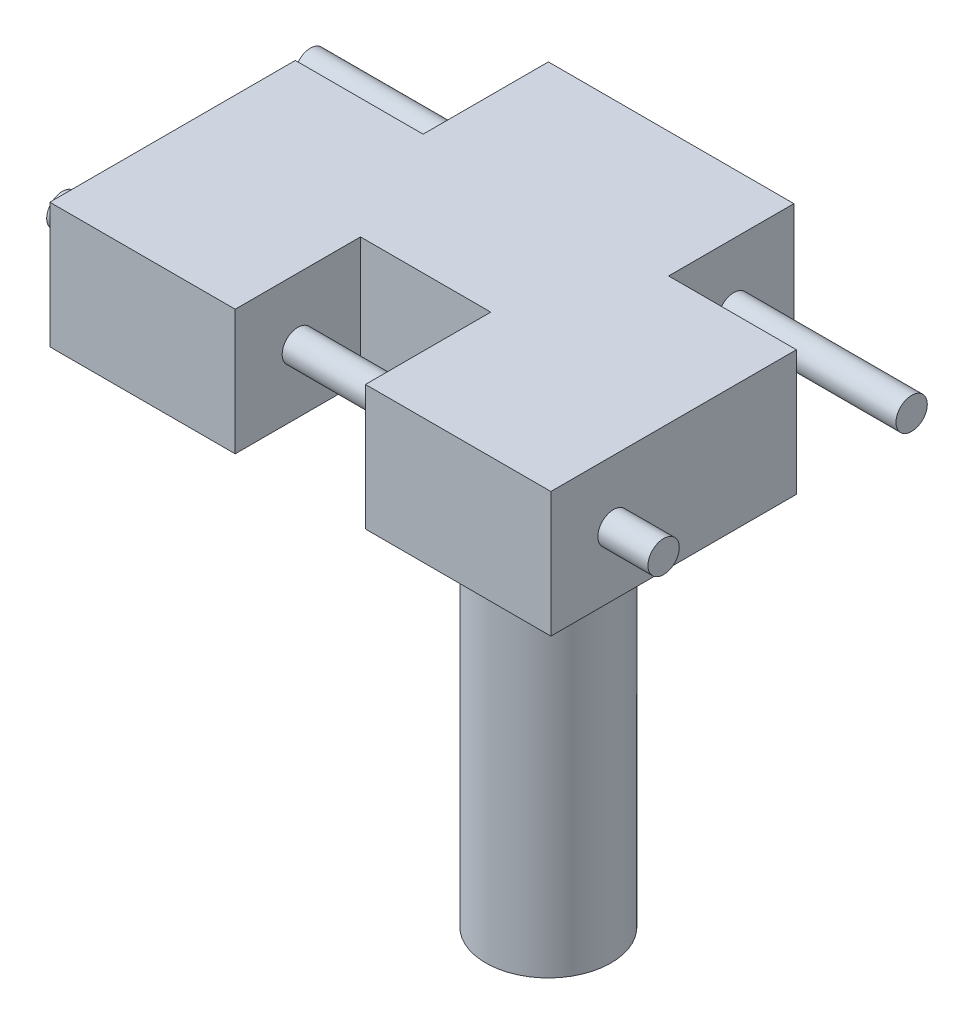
from build123d import *

# Parameters (mm, degrees)
FINGERBASE_DEPTH         = 6.35
BOSS_EXTRUDE1_DEPTH      = 2.54
BOSS_EXTRUDE1_DEPTH_BACK = 27.94
SKETCH2_R                = 0.79375
SKETCH3_R                = 3.175
BOSS_EXTRUDE2_DEPTH      = 25.4


with BuildPart() as part:
    # Sketch1 → FingerBase (new body)
    with BuildSketch(Plane(origin=(0, 0, 0), x_dir=(1, 0, 0), z_dir=(0, 1, 0))):
        Polygon((-6.223, 6.223), (6.223, 6.223), (6.223, -0.127), (12.7, -0.127), (12.7, -12.573), (3.302, -12.573), (3.302, -6.223), (-3.302, -6.223), (-3.302, -12.573), (-12.7, -12.573), (-12.7, -0.127), (-6.223, -0.127), align=None)
    extrude(amount=FINGERBASE_DEPTH)

    # Sketch2 → Boss-Extrude1 (add, two sides: drawn at the far end of the back side and taken through both)
    with BuildSketch(Plane(origin=(12.7, 0, 0), x_dir=(0, 0, -1), z_dir=(1, 0, 0)).offset(-BOSS_EXTRUDE1_DEPTH_BACK)):
        with Locations((-9.398, 3.175)):
            Circle(SKETCH2_R)
        with Locations((3.175, 3.175)):
            Circle(SKETCH2_R)
    extrude(amount=BOSS_EXTRUDE1_DEPTH + BOSS_EXTRUDE1_DEPTH_BACK)

    # Sketch3 → Boss-Extrude2 (add)
    with BuildSketch(Plane.XZ):
        with Locations(Location((0, 0, 0), (0, 0, 270))):
            Circle(SKETCH3_R)
    extrude(amount=BOSS_EXTRUDE2_DEPTH)


solid = part.part
